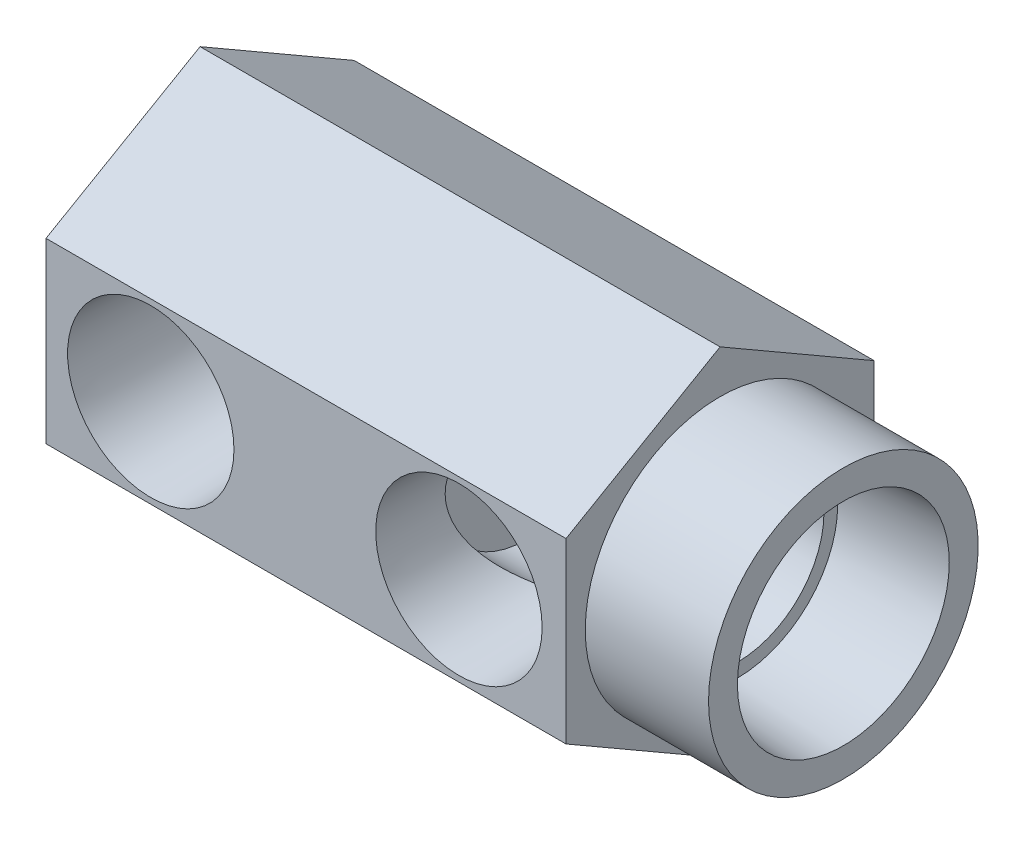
from build123d import *

# Parameters (mm, degrees)
BOSS_EXTRUDE1_DEPTH                = 42.8625
SKETCH2_R                          = 11.1125
BOSS_EXTRUDE2_DEPTH                = 53.0225
F_1_4_NPT_TAPPED_HOLE1_AT_2_COUNT  = 2
F_1_4_NPT_TAPPED_HOLE1_AT_2_PITCH  = 25.4
I_0_272_DIAMETER_HOLE1_D           = 6.9088
I_0_272_DIAMETER_HOLE1_DEPTH       = 41.275
I_0_272_DIAMETER_HOLE1_TIP         = 2.075612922
F_5_16_0_3125_DIAMETER_HOLE1_D     = 7.9375
F_5_16_0_3125_DIAMETER_HOLE1_DEPTH = 36.576
F_5_16_0_3125_DIAMETER_HOLE1_TIP   = 2.384665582


with BuildPart() as part:
    # Sketch1 → Boss-Extrude1 (new body)
    with BuildSketch(Plane(origin=(0, 0, 0), x_dir=(0, 0, -1), z_dir=(1, 0, 0))):
        Polygon((12.7, 7.332348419), (0, 14.664696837), (-12.7, 7.332348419), (-12.7, -7.332348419), (0, -14.664696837), (12.7, -7.332348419), align=None)
    extrude(amount=BOSS_EXTRUDE1_DEPTH)

    # Sketch2 → Boss-Extrude2 (add)
    with BuildSketch(Plane.ZY):
        Circle(SKETCH2_R)
    extrude(amount=-BOSS_EXTRUDE2_DEPTH)

    # Sketch3 → Cut-Revolve1 (revolve, cut)
    with BuildSketch(Plane(origin=(0, 0, 0), x_dir=(1, 0, 0), z_dir=(0, 1, 0)), mode=Mode.PRIVATE) as cut_revolve1_sk:
        Polygon((44.2849, 7.14375), (44.2849, 8.273331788), (53.0225, 8.73125), (53.0225, 0), (26.82875, 0), (26.82875, 7.14375), align=None)
    revolve(cut_revolve1_sk.sketch.rotate(Axis((0, 0, 0), (1, 0, 0)), 180), axis=Axis((0, 0, 0), (1, 0, 0)), mode=Mode.SUBTRACT)

    # Sketch4 → 1_4 NPT Tapped Hole1 (revolve, cut)
    with BuildSketch(Plane(origin=(8.636, 0, 12.7), x_dir=(0, -1, 0), z_dir=(1, 0, 0))):
        Polygon((0, 0), (0, 19.217347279), (5.5626, 15.875), (5.5626, 10.0203), (6.557978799, 10.0203), (6.858, 0), align=None)
    f_1_4_npt_tapped_hole1 = revolve(axis=Axis((8.636, 0, 19.05), (0, 0, -1)), mode=Mode.SUBTRACT)

    # 1_4 NPT Tapped Hole1 at 2: 1_4 NPT Tapped Hole1 ×2
    with Locations(*[(i * F_1_4_NPT_TAPPED_HOLE1_AT_2_PITCH, 0, 0) for i in range(1, F_1_4_NPT_TAPPED_HOLE1_AT_2_COUNT)]):
        add(f_1_4_npt_tapped_hole1, mode=Mode.SUBTRACT)

    # Sketch6 → 1_4 NPT Tapped Hole2 (revolve, cut)
    with BuildSketch(Plane(origin=(8.636, 0, -12.7), x_dir=(0, 1, 0), z_dir=(1, 0, 0))):
        Polygon((0, 0), (0, 20.411147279), (5.5626, 17.0688), (5.5626, 10.0203), (6.557978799, 10.0203), (6.858, 0), align=None)
    revolve(axis=Axis((8.636, 0, -19.05), (0, 0, 1)), mode=Mode.SUBTRACT)

    # I _0.272_ Diameter Hole1
    with Locations(Plane(origin=(53.0225, 0, 0), x_dir=(0, 0, -1), z_dir=(1, 0, 0))):
        with Locations((0, 0)):
            Hole(I_0_272_DIAMETER_HOLE1_D / 2, depth=I_0_272_DIAMETER_HOLE1_DEPTH)
            with Locations((0, 0, -(I_0_272_DIAMETER_HOLE1_DEPTH + I_0_272_DIAMETER_HOLE1_TIP / 2))):  # 118° drill point
                Cone(0, I_0_272_DIAMETER_HOLE1_D / 2, I_0_272_DIAMETER_HOLE1_TIP, mode=Mode.SUBTRACT)

    # 5_16 _0.3125_ Diameter Hole1
    with Locations(Plane(origin=(53.0225, 0, 0), x_dir=(0, 0, -1), z_dir=(1, 0, 0))):
        with Locations((0, 0)):
            Hole(F_5_16_0_3125_DIAMETER_HOLE1_D / 2, depth=F_5_16_0_3125_DIAMETER_HOLE1_DEPTH)
            with Locations((0, 0, -(F_5_16_0_3125_DIAMETER_HOLE1_DEPTH + F_5_16_0_3125_DIAMETER_HOLE1_TIP / 2))):  # 118° drill point
                Cone(0, F_5_16_0_3125_DIAMETER_HOLE1_D / 2, F_5_16_0_3125_DIAMETER_HOLE1_TIP, mode=Mode.SUBTRACT)


solid = part.part
